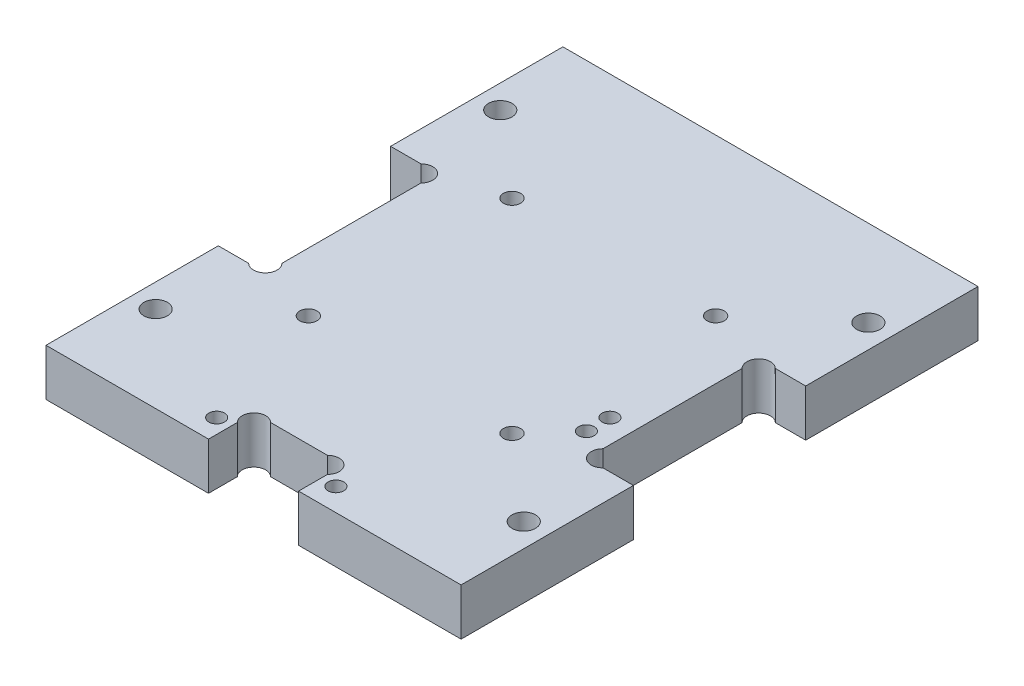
from build123d import *

# Parameters (mm, degrees)
ESQUISSE1_R      = 1.5
ESQUISSE1_R_2    = 1.1
ESQUISSE1_R_3    = 1
EXTRUSION1_DEPTH = 6


with BuildPart() as part:
    # Esquisse1 → Extrusion1 (new body)
    with BuildSketch(Plane(origin=(0, 0, 0), x_dir=(1, 0, 0), z_dir=(0, 1, 0))):
        with BuildLine():
            Line((-13.121320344, 11), (-17, 11))
            Line((-17, 11), (-17, 33))
            Line((-17, 33), (36, 33))
            Line((36, 33), (36, 11))
            Line((36, 11), (32.121320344, 11))
            ThreePointArc((32.121320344, 11), (30, 11), (30, 8.878679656))
            Line((30, 8.878679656), (30, -8.878679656))
            ThreePointArc((30, -8.878679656), (30, -11), (32.121320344, -11))
            Line((32.121320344, -11), (36, -11))
            Line((36, -11), (36, -33))
            Line((36, -33), (15.25, -33))
            Line((15.25, -33), (15.25, -29.321320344))
            ThreePointArc((15.25, -29.321320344), (15.25, -27.2), (13.128679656, -27.2))
            Line((13.128679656, -27.2), (5.871320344, -27.2))
            ThreePointArc((5.871320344, -27.2), (3.75, -27.2), (3.75, -29.321320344))
            Line((3.75, -29.321320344), (3.75, -33))
            Line((3.75, -33), (-17, -33))
            Line((-17, -33), (-17, -11))
            Line((-17, -11), (-13.121320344, -11))
            ThreePointArc((-13.121320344, -11), (-11, -11), (-11, -8.878679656))
            Line((-11, -8.878679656), (-11, 8.878679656))
            ThreePointArc((-11, 8.878679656), (-11, 11), (-13.121320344, 11))
        make_face()
        with Locations(Location((-14, 22, 0), (0, 0, 270))):
            Circle(ESQUISSE1_R, mode=Mode.SUBTRACT)
        with Locations(Location((33, 22, 0), (0, 0, 90))):
            Circle(ESQUISSE1_R, mode=Mode.SUBTRACT)
        with Locations(Location((-14, -22, 0), (0, 0, 90))):
            Circle(ESQUISSE1_R, mode=Mode.SUBTRACT)
        with Locations(Location((33, -22, 0), (0, 0, 270))):
            Circle(ESQUISSE1_R, mode=Mode.SUBTRACT)
        with Locations(Location((22.5, -13, 0), (0, 0, 270))):
            Circle(ESQUISSE1_R_2, mode=Mode.SUBTRACT)
        with Locations(Location((-3.5, -13, 0), (0, 0, 270))):
            Circle(ESQUISSE1_R_2, mode=Mode.SUBTRACT)
        with Locations(Location((22.5, 13, 0), (0, 0, 90))):
            Circle(ESQUISSE1_R_2, mode=Mode.SUBTRACT)
        with Locations(Location((-3.5, 13, 0), (0, 0, 90))):
            Circle(ESQUISSE1_R_2, mode=Mode.SUBTRACT)
        with Locations(Location((1.89, -30.1, 0), (0, 0, 270))):
            Circle(ESQUISSE1_R_3, mode=Mode.SUBTRACT)
        with Locations(Location((17.11, -30.1, 0), (0, 0, 90))):
            Circle(ESQUISSE1_R_3, mode=Mode.SUBTRACT)
        with Locations(Location((27, -5, 0), (0, 0, 270))):
            Circle(ESQUISSE1_R_3, mode=Mode.SUBTRACT)
        with Locations(Location((27, -8, 0), (0, 0, 270))):
            Circle(ESQUISSE1_R_3, mode=Mode.SUBTRACT)
    extrude(amount=EXTRUSION1_DEPTH)


solid = part.part
